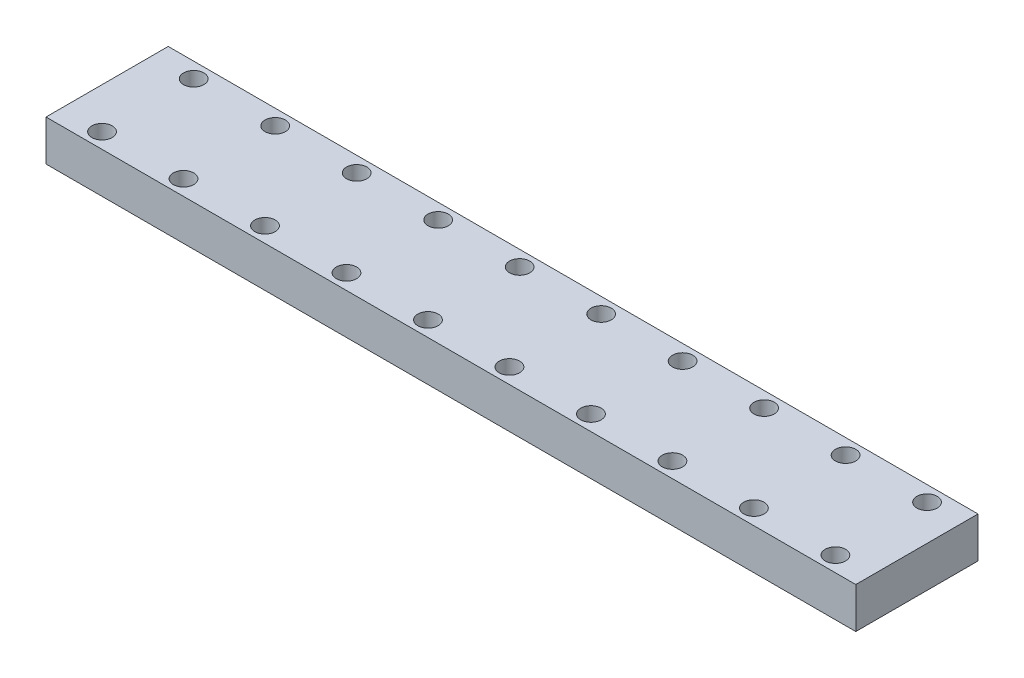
ISO-10303-21;
HEADER;
FILE_DESCRIPTION(('STEP AP214'),'2;1');
FILE_NAME('part.step','',(''),(''),'','','');
FILE_SCHEMA(('AUTOMOTIVE_DESIGN { 1 0 10303 214 1 1 1 1 }'));
ENDSEC;
DATA;
#1=APPLICATION_CONTEXT('core data for automotive mechanical design processes');
#2=APPLICATION_PROTOCOL_DEFINITION('international standard','automotive_design',2000,#1);
#3=PRODUCT_CONTEXT('',#1,'mechanical');
#4=PRODUCT('Part','Part','',(#3));
#5=PRODUCT_RELATED_PRODUCT_CATEGORY('part','',(#4));
#6=PRODUCT_DEFINITION_FORMATION('','',#4);
#7=PRODUCT_DEFINITION_CONTEXT('part definition',#1,'design');
#8=PRODUCT_DEFINITION('design','',#6,#7);
#9=PRODUCT_DEFINITION_SHAPE('','',#8);
#10=(LENGTH_UNIT() NAMED_UNIT(*) SI_UNIT(.MILLI.,.METRE.));
#11=(NAMED_UNIT(*) PLANE_ANGLE_UNIT() SI_UNIT($,.RADIAN.));
#12=(NAMED_UNIT(*) SI_UNIT($,.STERADIAN.) SOLID_ANGLE_UNIT());
#13=UNCERTAINTY_MEASURE_WITH_UNIT(LENGTH_MEASURE(1.E-05),#10,'distance_accuracy_value','');
#14=(GEOMETRIC_REPRESENTATION_CONTEXT(3) GLOBAL_UNCERTAINTY_ASSIGNED_CONTEXT((#13)) GLOBAL_UNIT_ASSIGNED_CONTEXT((#10,
#11,#12)) REPRESENTATION_CONTEXT('',''));
#15=CARTESIAN_POINT('',(0.,0.,0.));
#16=DIRECTION('',(0.,0.,1.));
#17=DIRECTION('',(1.,0.,0.));
#18=AXIS2_PLACEMENT_3D('',#15,#16,#17);
#19=CARTESIAN_POINT('',(0.,8.,0.));
#20=DIRECTION('',(0.,1.,0.));
#21=DIRECTION('',(0.,0.,1.));
#22=AXIS2_PLACEMENT_3D('',#19,#20,#21);
#23=PLANE('',#22);
#24=CARTESIAN_POINT('',(111.269565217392,8.,9.83478260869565));
#25=DIRECTION('',(0.,1.,0.));
#26=DIRECTION('',(0.,0.,1.));
#27=AXIS2_PLACEMENT_3D('',#24,#25,#26);
#28=CIRCLE('',#27,2.);
#29=CARTESIAN_POINT('',(111.269565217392,8.,11.8347826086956));
#30=VERTEX_POINT('',#29);
#31=EDGE_CURVE('E219',#30,#30,#28,.T.);
#32=ORIENTED_EDGE('',*,*,#31,.F.);
#33=EDGE_LOOP('',(#32));
#34=FACE_BOUND('',#33,.T.);
#35=CARTESIAN_POINT('',(79.2695652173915,8.,9.83478260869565));
#36=DIRECTION('',(0.,1.,0.));
#37=DIRECTION('',(0.,0.,1.));
#38=AXIS2_PLACEMENT_3D('',#35,#36,#37);
#39=CIRCLE('',#38,2.);
#40=CARTESIAN_POINT('',(79.2695652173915,8.,11.8347826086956));
#41=VERTEX_POINT('',#40);
#42=EDGE_CURVE('E207',#41,#41,#39,.T.);
#43=ORIENTED_EDGE('',*,*,#42,.F.);
#44=EDGE_LOOP('',(#43));
#45=FACE_BOUND('',#44,.T.);
#46=CARTESIAN_POINT('',(47.2695652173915,8.,9.83478260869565));
#47=DIRECTION('',(0.,1.,0.));
#48=DIRECTION('',(0.,0.,1.));
#49=AXIS2_PLACEMENT_3D('',#46,#47,#48);
#50=CIRCLE('',#49,2.);
#51=CARTESIAN_POINT('',(47.2695652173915,8.,11.8347826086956));
#52=VERTEX_POINT('',#51);
#53=EDGE_CURVE('E195',#52,#52,#50,.T.);
#54=ORIENTED_EDGE('',*,*,#53,.F.);
#55=EDGE_LOOP('',(#54));
#56=FACE_BOUND('',#55,.T.);
#57=CARTESIAN_POINT('',(15.2695652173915,8.,9.83478260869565));
#58=DIRECTION('',(0.,1.,0.));
#59=DIRECTION('',(0.,0.,1.));
#60=AXIS2_PLACEMENT_3D('',#57,#58,#59);
#61=CIRCLE('',#60,2.);
#62=CARTESIAN_POINT('',(15.2695652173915,8.,11.8347826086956));
#63=VERTEX_POINT('',#62);
#64=EDGE_CURVE('E183',#63,#63,#61,.T.);
#65=ORIENTED_EDGE('',*,*,#64,.F.);
#66=EDGE_LOOP('',(#65));
#67=FACE_BOUND('',#66,.T.);
#68=CARTESIAN_POINT('',(-16.7304347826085,8.,9.83478260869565));
#69=DIRECTION('',(0.,1.,0.));
#70=DIRECTION('',(0.,0.,1.));
#71=AXIS2_PLACEMENT_3D('',#68,#69,#70);
#72=CIRCLE('',#71,2.);
#73=CARTESIAN_POINT('',(-16.7304347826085,8.,11.8347826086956));
#74=VERTEX_POINT('',#73);
#75=EDGE_CURVE('E171',#74,#74,#72,.T.);
#76=ORIENTED_EDGE('',*,*,#75,.F.);
#77=EDGE_LOOP('',(#76));
#78=FACE_BOUND('',#77,.T.);
#79=CARTESIAN_POINT('',(111.269565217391,8.,-8.16521739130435));
#80=DIRECTION('',(0.,1.,0.));
#81=DIRECTION('',(0.,0.,1.));
#82=AXIS2_PLACEMENT_3D('',#79,#80,#81);
#83=CIRCLE('',#82,2.);
#84=CARTESIAN_POINT('',(111.269565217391,8.,-6.16521739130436));
#85=VERTEX_POINT('',#84);
#86=EDGE_CURVE('E159',#85,#85,#83,.T.);
#87=ORIENTED_EDGE('',*,*,#86,.F.);
#88=EDGE_LOOP('',(#87));
#89=FACE_BOUND('',#88,.T.);
#90=CARTESIAN_POINT('',(79.2695652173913,8.,-8.16521739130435));
#91=DIRECTION('',(0.,1.,0.));
#92=DIRECTION('',(0.,0.,1.));
#93=AXIS2_PLACEMENT_3D('',#90,#91,#92);
#94=CIRCLE('',#93,2.);
#95=CARTESIAN_POINT('',(79.2695652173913,8.,-6.16521739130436));
#96=VERTEX_POINT('',#95);
#97=EDGE_CURVE('E147',#96,#96,#94,.T.);
#98=ORIENTED_EDGE('',*,*,#97,.F.);
#99=EDGE_LOOP('',(#98));
#100=FACE_BOUND('',#99,.T.);
#101=CARTESIAN_POINT('',(47.2695652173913,8.,-8.16521739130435));
#102=DIRECTION('',(0.,1.,0.));
#103=DIRECTION('',(0.,0.,1.));
#104=AXIS2_PLACEMENT_3D('',#101,#102,#103);
#105=CIRCLE('',#104,2.);
#106=CARTESIAN_POINT('',(47.2695652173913,8.,-6.16521739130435));
#107=VERTEX_POINT('',#106);
#108=EDGE_CURVE('E135',#107,#107,#105,.T.);
#109=ORIENTED_EDGE('',*,*,#108,.F.);
#110=EDGE_LOOP('',(#109));
#111=FACE_BOUND('',#110,.T.);
#112=CARTESIAN_POINT('',(15.2695652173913,8.,-8.16521739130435));
#113=DIRECTION('',(0.,1.,0.));
#114=DIRECTION('',(0.,0.,1.));
#115=AXIS2_PLACEMENT_3D('',#112,#113,#114);
#116=CIRCLE('',#115,2.);
#117=CARTESIAN_POINT('',(15.2695652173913,8.,-6.16521739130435));
#118=VERTEX_POINT('',#117);
#119=EDGE_CURVE('E123',#118,#118,#116,.T.);
#120=ORIENTED_EDGE('',*,*,#119,.F.);
#121=EDGE_LOOP('',(#120));
#122=FACE_BOUND('',#121,.T.);
#123=CARTESIAN_POINT('',(-16.7304347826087,8.,-8.16521739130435));
#124=DIRECTION('',(0.,1.,0.));
#125=DIRECTION('',(0.,0.,1.));
#126=AXIS2_PLACEMENT_3D('',#123,#124,#125);
#127=CIRCLE('',#126,2.);
#128=CARTESIAN_POINT('',(-16.7304347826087,8.,-6.16521739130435));
#129=VERTEX_POINT('',#128);
#130=EDGE_CURVE('E102',#129,#129,#127,.T.);
#131=ORIENTED_EDGE('',*,*,#130,.F.);
#132=EDGE_LOOP('',(#131));
#133=FACE_BOUND('',#132,.T.);
#134=DIRECTION('',(0.,0.,1.));
#135=VECTOR('',#134,1.);
#136=CARTESIAN_POINT('',(-24.7304347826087,8.,-11.1652173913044));
#137=LINE('',#136,#135);
#138=CARTESIAN_POINT('',(-24.7304347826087,8.,-11.1652173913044));
#139=VERTEX_POINT('',#138);
#140=CARTESIAN_POINT('',(-24.7304347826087,8.,12.8347826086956));
#141=VERTEX_POINT('',#140);
#142=EDGE_CURVE('E87',#139,#141,#137,.T.);
#143=ORIENTED_EDGE('',*,*,#142,.T.);
#144=DIRECTION('',(1.,0.,0.));
#145=VECTOR('',#144,1.);
#146=CARTESIAN_POINT('',(-24.7304347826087,8.,12.8347826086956));
#147=LINE('',#146,#145);
#148=CARTESIAN_POINT('',(134.269565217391,8.,12.8347826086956));
#149=VERTEX_POINT('',#148);
#150=EDGE_CURVE('E82',#141,#149,#147,.T.);
#151=ORIENTED_EDGE('',*,*,#150,.T.);
#152=DIRECTION('',(0.,0.,-1.));
#153=VECTOR('',#152,1.);
#154=CARTESIAN_POINT('',(134.269565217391,8.,-11.1652173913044));
#155=LINE('',#154,#153);
#156=CARTESIAN_POINT('',(134.269565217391,8.,-11.1652173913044));
#157=VERTEX_POINT('',#156);
#158=EDGE_CURVE('E85',#149,#157,#155,.T.);
#159=ORIENTED_EDGE('',*,*,#158,.T.);
#160=DIRECTION('',(-1.,0.,0.));
#161=VECTOR('',#160,1.);
#162=CARTESIAN_POINT('',(-24.7304347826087,8.,-11.1652173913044));
#163=LINE('',#162,#161);
#164=EDGE_CURVE('E52',#157,#139,#163,.T.);
#165=ORIENTED_EDGE('',*,*,#164,.T.);
#166=EDGE_LOOP('',(#143,#151,#159,#165));
#167=FACE_BOUND('',#166,.T.);
#168=CARTESIAN_POINT('',(-0.730434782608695,8.,-8.16521739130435));
#169=DIRECTION('',(0.,1.,0.));
#170=DIRECTION('',(0.,0.,1.));
#171=AXIS2_PLACEMENT_3D('',#168,#169,#170);
#172=CIRCLE('',#171,2.);
#173=CARTESIAN_POINT('',(-0.730434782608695,8.,-6.16521739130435));
#174=VERTEX_POINT('',#173);
#175=EDGE_CURVE('E117',#174,#174,#172,.T.);
#176=ORIENTED_EDGE('',*,*,#175,.F.);
#177=EDGE_LOOP('',(#176));
#178=FACE_BOUND('',#177,.T.);
#179=CARTESIAN_POINT('',(31.2695652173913,8.,-8.16521739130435));
#180=DIRECTION('',(0.,1.,0.));
#181=DIRECTION('',(0.,0.,1.));
#182=AXIS2_PLACEMENT_3D('',#179,#180,#181);
#183=CIRCLE('',#182,2.);
#184=CARTESIAN_POINT('',(31.2695652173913,8.,-6.16521739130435));
#185=VERTEX_POINT('',#184);
#186=EDGE_CURVE('E129',#185,#185,#183,.T.);
#187=ORIENTED_EDGE('',*,*,#186,.F.);
#188=EDGE_LOOP('',(#187));
#189=FACE_BOUND('',#188,.T.);
#190=CARTESIAN_POINT('',(63.2695652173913,8.,-8.16521739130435));
#191=DIRECTION('',(0.,1.,0.));
#192=DIRECTION('',(0.,0.,1.));
#193=AXIS2_PLACEMENT_3D('',#190,#191,#192);
#194=CIRCLE('',#193,2.00000000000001);
#195=CARTESIAN_POINT('',(63.2695652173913,8.,-6.16521739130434));
#196=VERTEX_POINT('',#195);
#197=EDGE_CURVE('E141',#196,#196,#194,.T.);
#198=ORIENTED_EDGE('',*,*,#197,.F.);
#199=EDGE_LOOP('',(#198));
#200=FACE_BOUND('',#199,.T.);
#201=CARTESIAN_POINT('',(95.2695652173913,8.,-8.16521739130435));
#202=DIRECTION('',(0.,1.,0.));
#203=DIRECTION('',(0.,0.,1.));
#204=AXIS2_PLACEMENT_3D('',#201,#202,#203);
#205=CIRCLE('',#204,2.00000000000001);
#206=CARTESIAN_POINT('',(95.2695652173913,8.,-6.16521739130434));
#207=VERTEX_POINT('',#206);
#208=EDGE_CURVE('E153',#207,#207,#205,.T.);
#209=ORIENTED_EDGE('',*,*,#208,.F.);
#210=EDGE_LOOP('',(#209));
#211=FACE_BOUND('',#210,.T.);
#212=CARTESIAN_POINT('',(127.269565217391,8.,-8.16521739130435));
#213=DIRECTION('',(0.,1.,0.));
#214=DIRECTION('',(0.,0.,1.));
#215=AXIS2_PLACEMENT_3D('',#212,#213,#214);
#216=CIRCLE('',#215,2.);
#217=CARTESIAN_POINT('',(127.269565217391,8.,-6.16521739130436));
#218=VERTEX_POINT('',#217);
#219=EDGE_CURVE('E165',#218,#218,#216,.T.);
#220=ORIENTED_EDGE('',*,*,#219,.F.);
#221=EDGE_LOOP('',(#220));
#222=FACE_BOUND('',#221,.T.);
#223=CARTESIAN_POINT('',(-0.730434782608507,8.,9.83478260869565));
#224=DIRECTION('',(0.,1.,0.));
#225=DIRECTION('',(0.,0.,1.));
#226=AXIS2_PLACEMENT_3D('',#223,#224,#225);
#227=CIRCLE('',#226,2.);
#228=CARTESIAN_POINT('',(-0.730434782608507,8.,11.8347826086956));
#229=VERTEX_POINT('',#228);
#230=EDGE_CURVE('E177',#229,#229,#227,.T.);
#231=ORIENTED_EDGE('',*,*,#230,.F.);
#232=EDGE_LOOP('',(#231));
#233=FACE_BOUND('',#232,.T.);
#234=CARTESIAN_POINT('',(31.2695652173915,8.,9.83478260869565));
#235=DIRECTION('',(0.,1.,0.));
#236=DIRECTION('',(0.,0.,1.));
#237=AXIS2_PLACEMENT_3D('',#234,#235,#236);
#238=CIRCLE('',#237,2.);
#239=CARTESIAN_POINT('',(31.2695652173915,8.,11.8347826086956));
#240=VERTEX_POINT('',#239);
#241=EDGE_CURVE('E189',#240,#240,#238,.T.);
#242=ORIENTED_EDGE('',*,*,#241,.F.);
#243=EDGE_LOOP('',(#242));
#244=FACE_BOUND('',#243,.T.);
#245=CARTESIAN_POINT('',(63.2695652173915,8.,9.83478260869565));
#246=DIRECTION('',(0.,1.,0.));
#247=DIRECTION('',(0.,0.,1.));
#248=AXIS2_PLACEMENT_3D('',#245,#246,#247);
#249=CIRCLE('',#248,2.00000000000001);
#250=CARTESIAN_POINT('',(63.2695652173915,8.,11.8347826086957));
#251=VERTEX_POINT('',#250);
#252=EDGE_CURVE('E201',#251,#251,#249,.T.);
#253=ORIENTED_EDGE('',*,*,#252,.F.);
#254=EDGE_LOOP('',(#253));
#255=FACE_BOUND('',#254,.T.);
#256=CARTESIAN_POINT('',(95.2695652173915,8.,9.83478260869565));
#257=DIRECTION('',(0.,1.,0.));
#258=DIRECTION('',(0.,0.,1.));
#259=AXIS2_PLACEMENT_3D('',#256,#257,#258);
#260=CIRCLE('',#259,2.00000000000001);
#261=CARTESIAN_POINT('',(95.2695652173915,8.,11.8347826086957));
#262=VERTEX_POINT('',#261);
#263=EDGE_CURVE('E213',#262,#262,#260,.T.);
#264=ORIENTED_EDGE('',*,*,#263,.F.);
#265=EDGE_LOOP('',(#264));
#266=FACE_BOUND('',#265,.T.);
#267=CARTESIAN_POINT('',(127.269565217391,8.,9.83478260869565));
#268=DIRECTION('',(0.,1.,0.));
#269=DIRECTION('',(0.,0.,1.));
#270=AXIS2_PLACEMENT_3D('',#267,#268,#269);
#271=CIRCLE('',#270,2.);
#272=CARTESIAN_POINT('',(127.269565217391,8.,11.8347826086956));
#273=VERTEX_POINT('',#272);
#274=EDGE_CURVE('E225',#273,#273,#271,.T.);
#275=ORIENTED_EDGE('',*,*,#274,.F.);
#276=EDGE_LOOP('',(#275));
#277=FACE_BOUND('',#276,.T.);
#278=ADVANCED_FACE('F35',(#34,#45,#56,#67,#78,#89,#100,#111,#122,#133,#167,#178,#189,#200,#211,
#222,#233,#244,#255,#266,#277),#23,.T.);
#279=CARTESIAN_POINT('',(0.,0.,0.));
#280=DIRECTION('',(0.,1.,0.));
#281=DIRECTION('',(0.,0.,1.));
#282=AXIS2_PLACEMENT_3D('',#279,#280,#281);
#283=PLANE('',#282);
#284=DIRECTION('',(0.,0.,1.));
#285=VECTOR('',#284,1.);
#286=CARTESIAN_POINT('',(-24.7304347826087,0.,-11.1652173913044));
#287=LINE('',#286,#285);
#288=CARTESIAN_POINT('',(-24.7304347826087,0.,-11.1652173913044));
#289=VERTEX_POINT('',#288);
#290=CARTESIAN_POINT('',(-24.7304347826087,0.,12.8347826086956));
#291=VERTEX_POINT('',#290);
#292=EDGE_CURVE('E99',#289,#291,#287,.T.);
#293=ORIENTED_EDGE('',*,*,#292,.F.);
#294=DIRECTION('',(-1.,0.,0.));
#295=VECTOR('',#294,1.);
#296=CARTESIAN_POINT('',(-24.7304347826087,0.,-11.1652173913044));
#297=LINE('',#296,#295);
#298=CARTESIAN_POINT('',(134.269565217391,0.,-11.1652173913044));
#299=VERTEX_POINT('',#298);
#300=EDGE_CURVE('E75',#299,#289,#297,.T.);
#301=ORIENTED_EDGE('',*,*,#300,.F.);
#302=DIRECTION('',(0.,0.,-1.));
#303=VECTOR('',#302,1.);
#304=CARTESIAN_POINT('',(134.269565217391,0.,-11.1652173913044));
#305=LINE('',#304,#303);
#306=CARTESIAN_POINT('',(134.269565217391,0.,12.8347826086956));
#307=VERTEX_POINT('',#306);
#308=EDGE_CURVE('E69',#307,#299,#305,.T.);
#309=ORIENTED_EDGE('',*,*,#308,.F.);
#310=DIRECTION('',(1.,0.,0.));
#311=VECTOR('',#310,1.);
#312=CARTESIAN_POINT('',(-24.7304347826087,0.,12.8347826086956));
#313=LINE('',#312,#311);
#314=EDGE_CURVE('E91',#291,#307,#313,.T.);
#315=ORIENTED_EDGE('',*,*,#314,.F.);
#316=EDGE_LOOP('',(#293,#301,#309,#315));
#317=FACE_BOUND('',#316,.T.);
#318=CARTESIAN_POINT('',(-16.7304347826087,0.,-8.16521739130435));
#319=DIRECTION('',(0.,1.,0.));
#320=DIRECTION('',(0.,0.,1.));
#321=AXIS2_PLACEMENT_3D('',#318,#319,#320);
#322=CIRCLE('',#321,2.);
#323=CARTESIAN_POINT('',(-16.7304347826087,0.,-6.16521739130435));
#324=VERTEX_POINT('',#323);
#325=EDGE_CURVE('E114',#324,#324,#322,.T.);
#326=ORIENTED_EDGE('',*,*,#325,.T.);
#327=EDGE_LOOP('',(#326));
#328=FACE_BOUND('',#327,.T.);
#329=CARTESIAN_POINT('',(-0.730434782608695,0.,-8.16521739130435));
#330=DIRECTION('',(0.,1.,0.));
#331=DIRECTION('',(0.,0.,1.));
#332=AXIS2_PLACEMENT_3D('',#329,#330,#331);
#333=CIRCLE('',#332,2.);
#334=CARTESIAN_POINT('',(-0.730434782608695,0.,-6.16521739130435));
#335=VERTEX_POINT('',#334);
#336=EDGE_CURVE('E120',#335,#335,#333,.T.);
#337=ORIENTED_EDGE('',*,*,#336,.T.);
#338=EDGE_LOOP('',(#337));
#339=FACE_BOUND('',#338,.T.);
#340=CARTESIAN_POINT('',(15.2695652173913,0.,-8.16521739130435));
#341=DIRECTION('',(0.,1.,0.));
#342=DIRECTION('',(0.,0.,1.));
#343=AXIS2_PLACEMENT_3D('',#340,#341,#342);
#344=CIRCLE('',#343,2.);
#345=CARTESIAN_POINT('',(15.2695652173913,0.,-6.16521739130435));
#346=VERTEX_POINT('',#345);
#347=EDGE_CURVE('E126',#346,#346,#344,.T.);
#348=ORIENTED_EDGE('',*,*,#347,.T.);
#349=EDGE_LOOP('',(#348));
#350=FACE_BOUND('',#349,.T.);
#351=CARTESIAN_POINT('',(31.2695652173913,0.,-8.16521739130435));
#352=DIRECTION('',(0.,1.,0.));
#353=DIRECTION('',(0.,0.,1.));
#354=AXIS2_PLACEMENT_3D('',#351,#352,#353);
#355=CIRCLE('',#354,2.);
#356=CARTESIAN_POINT('',(31.2695652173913,0.,-6.16521739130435));
#357=VERTEX_POINT('',#356);
#358=EDGE_CURVE('E132',#357,#357,#355,.T.);
#359=ORIENTED_EDGE('',*,*,#358,.T.);
#360=EDGE_LOOP('',(#359));
#361=FACE_BOUND('',#360,.T.);
#362=CARTESIAN_POINT('',(47.2695652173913,0.,-8.16521739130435));
#363=DIRECTION('',(0.,1.,0.));
#364=DIRECTION('',(0.,0.,1.));
#365=AXIS2_PLACEMENT_3D('',#362,#363,#364);
#366=CIRCLE('',#365,2.);
#367=CARTESIAN_POINT('',(47.2695652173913,0.,-6.16521739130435));
#368=VERTEX_POINT('',#367);
#369=EDGE_CURVE('E138',#368,#368,#366,.T.);
#370=ORIENTED_EDGE('',*,*,#369,.T.);
#371=EDGE_LOOP('',(#370));
#372=FACE_BOUND('',#371,.T.);
#373=CARTESIAN_POINT('',(63.2695652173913,0.,-8.16521739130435));
#374=DIRECTION('',(0.,1.,0.));
#375=DIRECTION('',(0.,0.,1.));
#376=AXIS2_PLACEMENT_3D('',#373,#374,#375);
#377=CIRCLE('',#376,2.00000000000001);
#378=CARTESIAN_POINT('',(63.2695652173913,0.,-6.16521739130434));
#379=VERTEX_POINT('',#378);
#380=EDGE_CURVE('E144',#379,#379,#377,.T.);
#381=ORIENTED_EDGE('',*,*,#380,.T.);
#382=EDGE_LOOP('',(#381));
#383=FACE_BOUND('',#382,.T.);
#384=CARTESIAN_POINT('',(79.2695652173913,0.,-8.16521739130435));
#385=DIRECTION('',(0.,1.,0.));
#386=DIRECTION('',(0.,0.,1.));
#387=AXIS2_PLACEMENT_3D('',#384,#385,#386);
#388=CIRCLE('',#387,2.);
#389=CARTESIAN_POINT('',(79.2695652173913,0.,-6.16521739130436));
#390=VERTEX_POINT('',#389);
#391=EDGE_CURVE('E150',#390,#390,#388,.T.);
#392=ORIENTED_EDGE('',*,*,#391,.T.);
#393=EDGE_LOOP('',(#392));
#394=FACE_BOUND('',#393,.T.);
#395=CARTESIAN_POINT('',(95.2695652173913,0.,-8.16521739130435));
#396=DIRECTION('',(0.,1.,0.));
#397=DIRECTION('',(0.,0.,1.));
#398=AXIS2_PLACEMENT_3D('',#395,#396,#397);
#399=CIRCLE('',#398,2.00000000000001);
#400=CARTESIAN_POINT('',(95.2695652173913,0.,-6.16521739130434));
#401=VERTEX_POINT('',#400);
#402=EDGE_CURVE('E156',#401,#401,#399,.T.);
#403=ORIENTED_EDGE('',*,*,#402,.T.);
#404=EDGE_LOOP('',(#403));
#405=FACE_BOUND('',#404,.T.);
#406=CARTESIAN_POINT('',(111.269565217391,0.,-8.16521739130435));
#407=DIRECTION('',(0.,1.,0.));
#408=DIRECTION('',(0.,0.,1.));
#409=AXIS2_PLACEMENT_3D('',#406,#407,#408);
#410=CIRCLE('',#409,2.);
#411=CARTESIAN_POINT('',(111.269565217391,0.,-6.16521739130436));
#412=VERTEX_POINT('',#411);
#413=EDGE_CURVE('E162',#412,#412,#410,.T.);
#414=ORIENTED_EDGE('',*,*,#413,.T.);
#415=EDGE_LOOP('',(#414));
#416=FACE_BOUND('',#415,.T.);
#417=CARTESIAN_POINT('',(127.269565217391,0.,-8.16521739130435));
#418=DIRECTION('',(0.,1.,0.));
#419=DIRECTION('',(0.,0.,1.));
#420=AXIS2_PLACEMENT_3D('',#417,#418,#419);
#421=CIRCLE('',#420,2.);
#422=CARTESIAN_POINT('',(127.269565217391,0.,-6.16521739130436));
#423=VERTEX_POINT('',#422);
#424=EDGE_CURVE('E168',#423,#423,#421,.T.);
#425=ORIENTED_EDGE('',*,*,#424,.T.);
#426=EDGE_LOOP('',(#425));
#427=FACE_BOUND('',#426,.T.);
#428=CARTESIAN_POINT('',(-16.7304347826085,0.,9.83478260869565));
#429=DIRECTION('',(0.,1.,0.));
#430=DIRECTION('',(0.,0.,1.));
#431=AXIS2_PLACEMENT_3D('',#428,#429,#430);
#432=CIRCLE('',#431,2.);
#433=CARTESIAN_POINT('',(-16.7304347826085,0.,11.8347826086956));
#434=VERTEX_POINT('',#433);
#435=EDGE_CURVE('E174',#434,#434,#432,.T.);
#436=ORIENTED_EDGE('',*,*,#435,.T.);
#437=EDGE_LOOP('',(#436));
#438=FACE_BOUND('',#437,.T.);
#439=CARTESIAN_POINT('',(-0.730434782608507,0.,9.83478260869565));
#440=DIRECTION('',(0.,1.,0.));
#441=DIRECTION('',(0.,0.,1.));
#442=AXIS2_PLACEMENT_3D('',#439,#440,#441);
#443=CIRCLE('',#442,2.);
#444=CARTESIAN_POINT('',(-0.730434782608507,0.,11.8347826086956));
#445=VERTEX_POINT('',#444);
#446=EDGE_CURVE('E180',#445,#445,#443,.T.);
#447=ORIENTED_EDGE('',*,*,#446,.T.);
#448=EDGE_LOOP('',(#447));
#449=FACE_BOUND('',#448,.T.);
#450=CARTESIAN_POINT('',(15.2695652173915,0.,9.83478260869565));
#451=DIRECTION('',(0.,1.,0.));
#452=DIRECTION('',(0.,0.,1.));
#453=AXIS2_PLACEMENT_3D('',#450,#451,#452);
#454=CIRCLE('',#453,2.);
#455=CARTESIAN_POINT('',(15.2695652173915,0.,11.8347826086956));
#456=VERTEX_POINT('',#455);
#457=EDGE_CURVE('E186',#456,#456,#454,.T.);
#458=ORIENTED_EDGE('',*,*,#457,.T.);
#459=EDGE_LOOP('',(#458));
#460=FACE_BOUND('',#459,.T.);
#461=CARTESIAN_POINT('',(31.2695652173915,0.,9.83478260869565));
#462=DIRECTION('',(0.,1.,0.));
#463=DIRECTION('',(0.,0.,1.));
#464=AXIS2_PLACEMENT_3D('',#461,#462,#463);
#465=CIRCLE('',#464,2.);
#466=CARTESIAN_POINT('',(31.2695652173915,0.,11.8347826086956));
#467=VERTEX_POINT('',#466);
#468=EDGE_CURVE('E192',#467,#467,#465,.T.);
#469=ORIENTED_EDGE('',*,*,#468,.T.);
#470=EDGE_LOOP('',(#469));
#471=FACE_BOUND('',#470,.T.);
#472=CARTESIAN_POINT('',(47.2695652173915,0.,9.83478260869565));
#473=DIRECTION('',(0.,1.,0.));
#474=DIRECTION('',(0.,0.,1.));
#475=AXIS2_PLACEMENT_3D('',#472,#473,#474);
#476=CIRCLE('',#475,2.);
#477=CARTESIAN_POINT('',(47.2695652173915,0.,11.8347826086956));
#478=VERTEX_POINT('',#477);
#479=EDGE_CURVE('E198',#478,#478,#476,.T.);
#480=ORIENTED_EDGE('',*,*,#479,.T.);
#481=EDGE_LOOP('',(#480));
#482=FACE_BOUND('',#481,.T.);
#483=CARTESIAN_POINT('',(63.2695652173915,0.,9.83478260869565));
#484=DIRECTION('',(0.,1.,0.));
#485=DIRECTION('',(0.,0.,1.));
#486=AXIS2_PLACEMENT_3D('',#483,#484,#485);
#487=CIRCLE('',#486,2.00000000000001);
#488=CARTESIAN_POINT('',(63.2695652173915,0.,11.8347826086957));
#489=VERTEX_POINT('',#488);
#490=EDGE_CURVE('E204',#489,#489,#487,.T.);
#491=ORIENTED_EDGE('',*,*,#490,.T.);
#492=EDGE_LOOP('',(#491));
#493=FACE_BOUND('',#492,.T.);
#494=CARTESIAN_POINT('',(79.2695652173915,0.,9.83478260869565));
#495=DIRECTION('',(0.,1.,0.));
#496=DIRECTION('',(0.,0.,1.));
#497=AXIS2_PLACEMENT_3D('',#494,#495,#496);
#498=CIRCLE('',#497,2.);
#499=CARTESIAN_POINT('',(79.2695652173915,0.,11.8347826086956));
#500=VERTEX_POINT('',#499);
#501=EDGE_CURVE('E210',#500,#500,#498,.T.);
#502=ORIENTED_EDGE('',*,*,#501,.T.);
#503=EDGE_LOOP('',(#502));
#504=FACE_BOUND('',#503,.T.);
#505=CARTESIAN_POINT('',(95.2695652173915,0.,9.83478260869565));
#506=DIRECTION('',(0.,1.,0.));
#507=DIRECTION('',(0.,0.,1.));
#508=AXIS2_PLACEMENT_3D('',#505,#506,#507);
#509=CIRCLE('',#508,2.00000000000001);
#510=CARTESIAN_POINT('',(95.2695652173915,0.,11.8347826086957));
#511=VERTEX_POINT('',#510);
#512=EDGE_CURVE('E216',#511,#511,#509,.T.);
#513=ORIENTED_EDGE('',*,*,#512,.T.);
#514=EDGE_LOOP('',(#513));
#515=FACE_BOUND('',#514,.T.);
#516=CARTESIAN_POINT('',(111.269565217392,0.,9.83478260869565));
#517=DIRECTION('',(0.,1.,0.));
#518=DIRECTION('',(0.,0.,1.));
#519=AXIS2_PLACEMENT_3D('',#516,#517,#518);
#520=CIRCLE('',#519,2.);
#521=CARTESIAN_POINT('',(111.269565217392,0.,11.8347826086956));
#522=VERTEX_POINT('',#521);
#523=EDGE_CURVE('E222',#522,#522,#520,.T.);
#524=ORIENTED_EDGE('',*,*,#523,.T.);
#525=EDGE_LOOP('',(#524));
#526=FACE_BOUND('',#525,.T.);
#527=CARTESIAN_POINT('',(127.269565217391,0.,9.83478260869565));
#528=DIRECTION('',(0.,1.,0.));
#529=DIRECTION('',(0.,0.,1.));
#530=AXIS2_PLACEMENT_3D('',#527,#528,#529);
#531=CIRCLE('',#530,2.);
#532=CARTESIAN_POINT('',(127.269565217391,0.,11.8347826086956));
#533=VERTEX_POINT('',#532);
#534=EDGE_CURVE('E228',#533,#533,#531,.T.);
#535=ORIENTED_EDGE('',*,*,#534,.T.);
#536=EDGE_LOOP('',(#535));
#537=FACE_BOUND('',#536,.T.);
#538=ADVANCED_FACE('F110',(#317,#328,#339,#350,#361,#372,#383,#394,#405,#416,#427,#438,#449,
#460,#471,#482,#493,#504,#515,#526,#537),#283,.F.);
#539=CARTESIAN_POINT('',(-24.7304347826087,8.,-11.1652173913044));
#540=DIRECTION('',(1.,0.,0.));
#541=DIRECTION('',(0.,0.,-1.));
#542=AXIS2_PLACEMENT_3D('',#539,#540,#541);
#543=PLANE('',#542);
#544=ORIENTED_EDGE('',*,*,#292,.T.);
#545=DIRECTION('',(0.,-1.,0.));
#546=VECTOR('',#545,1.);
#547=CARTESIAN_POINT('',(-24.7304347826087,8.,12.8347826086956));
#548=LINE('',#547,#546);
#549=EDGE_CURVE('E11',#141,#291,#548,.T.);
#550=ORIENTED_EDGE('',*,*,#549,.F.);
#551=ORIENTED_EDGE('',*,*,#142,.F.);
#552=DIRECTION('',(0.,-1.,0.));
#553=VECTOR('',#552,1.);
#554=CARTESIAN_POINT('',(-24.7304347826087,8.,-11.1652173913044));
#555=LINE('',#554,#553);
#556=EDGE_CURVE('E95',#139,#289,#555,.T.);
#557=ORIENTED_EDGE('',*,*,#556,.T.);
#558=EDGE_LOOP('',(#544,#550,#551,#557));
#559=FACE_BOUND('',#558,.T.);
#560=ADVANCED_FACE('F37',(#559),#543,.F.);
#561=CARTESIAN_POINT('',(-24.7304347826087,8.,12.8347826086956));
#562=DIRECTION('',(0.,0.,-1.));
#563=DIRECTION('',(-1.,0.,0.));
#564=AXIS2_PLACEMENT_3D('',#561,#562,#563);
#565=PLANE('',#564);
#566=ORIENTED_EDGE('',*,*,#314,.T.);
#567=DIRECTION('',(0.,-1.,0.));
#568=VECTOR('',#567,1.);
#569=CARTESIAN_POINT('',(134.269565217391,8.,12.8347826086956));
#570=LINE('',#569,#568);
#571=EDGE_CURVE('E44',#149,#307,#570,.T.);
#572=ORIENTED_EDGE('',*,*,#571,.F.);
#573=ORIENTED_EDGE('',*,*,#150,.F.);
#574=ORIENTED_EDGE('',*,*,#549,.T.);
#575=EDGE_LOOP('',(#566,#572,#573,#574));
#576=FACE_BOUND('',#575,.T.);
#577=ADVANCED_FACE('F90',(#576),#565,.F.);
#578=CARTESIAN_POINT('',(134.269565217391,8.,-11.1652173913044));
#579=DIRECTION('',(-1.,0.,0.));
#580=DIRECTION('',(0.,0.,1.));
#581=AXIS2_PLACEMENT_3D('',#578,#579,#580);
#582=PLANE('',#581);
#583=ORIENTED_EDGE('',*,*,#308,.T.);
#584=DIRECTION('',(0.,-1.,0.));
#585=VECTOR('',#584,1.);
#586=CARTESIAN_POINT('',(134.269565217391,8.,-11.1652173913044));
#587=LINE('',#586,#585);
#588=EDGE_CURVE('E92',#157,#299,#587,.T.);
#589=ORIENTED_EDGE('',*,*,#588,.F.);
#590=ORIENTED_EDGE('',*,*,#158,.F.);
#591=ORIENTED_EDGE('',*,*,#571,.T.);
#592=EDGE_LOOP('',(#583,#589,#590,#591));
#593=FACE_BOUND('',#592,.T.);
#594=ADVANCED_FACE('F93',(#593),#582,.F.);
#595=CARTESIAN_POINT('',(-24.7304347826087,8.,-11.1652173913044));
#596=DIRECTION('',(0.,0.,1.));
#597=DIRECTION('',(1.,0.,0.));
#598=AXIS2_PLACEMENT_3D('',#595,#596,#597);
#599=PLANE('',#598);
#600=ORIENTED_EDGE('',*,*,#300,.T.);
#601=ORIENTED_EDGE('',*,*,#556,.F.);
#602=ORIENTED_EDGE('',*,*,#164,.F.);
#603=ORIENTED_EDGE('',*,*,#588,.T.);
#604=EDGE_LOOP('',(#600,#601,#602,#603));
#605=FACE_BOUND('',#604,.T.);
#606=ADVANCED_FACE('F107',(#605),#599,.F.);
#607=CARTESIAN_POINT('',(-16.7304347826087,8.,-8.16521739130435));
#608=DIRECTION('',(0.,-1.,0.));
#609=DIRECTION('',(0.,0.,-1.));
#610=AXIS2_PLACEMENT_3D('',#607,#608,#609);
#611=CYLINDRICAL_SURFACE('',#610,2.);
#612=ORIENTED_EDGE('',*,*,#130,.T.);
#613=EDGE_LOOP('',(#612));
#614=FACE_BOUND('',#613,.T.);
#615=ORIENTED_EDGE('',*,*,#325,.F.);
#616=EDGE_LOOP('',(#615));
#617=FACE_BOUND('',#616,.T.);
#618=ADVANCED_FACE('F247',(#614,#617),#611,.F.);
#619=CARTESIAN_POINT('',(-0.730434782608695,8.,-8.16521739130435));
#620=DIRECTION('',(0.,-1.,0.));
#621=DIRECTION('',(0.,0.,-1.));
#622=AXIS2_PLACEMENT_3D('',#619,#620,#621);
#623=CYLINDRICAL_SURFACE('',#622,2.);
#624=ORIENTED_EDGE('',*,*,#175,.T.);
#625=EDGE_LOOP('',(#624));
#626=FACE_BOUND('',#625,.T.);
#627=ORIENTED_EDGE('',*,*,#336,.F.);
#628=EDGE_LOOP('',(#627));
#629=FACE_BOUND('',#628,.T.);
#630=ADVANCED_FACE('F293',(#626,#629),#623,.F.);
#631=CARTESIAN_POINT('',(15.2695652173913,8.,-8.16521739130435));
#632=DIRECTION('',(0.,-1.,0.));
#633=DIRECTION('',(0.,0.,-1.));
#634=AXIS2_PLACEMENT_3D('',#631,#632,#633);
#635=CYLINDRICAL_SURFACE('',#634,2.);
#636=ORIENTED_EDGE('',*,*,#119,.T.);
#637=EDGE_LOOP('',(#636));
#638=FACE_BOUND('',#637,.T.);
#639=ORIENTED_EDGE('',*,*,#347,.F.);
#640=EDGE_LOOP('',(#639));
#641=FACE_BOUND('',#640,.T.);
#642=ADVANCED_FACE('F301',(#638,#641),#635,.F.);
#643=CARTESIAN_POINT('',(31.2695652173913,8.,-8.16521739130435));
#644=DIRECTION('',(0.,-1.,0.));
#645=DIRECTION('',(0.,0.,-1.));
#646=AXIS2_PLACEMENT_3D('',#643,#644,#645);
#647=CYLINDRICAL_SURFACE('',#646,2.);
#648=ORIENTED_EDGE('',*,*,#186,.T.);
#649=EDGE_LOOP('',(#648));
#650=FACE_BOUND('',#649,.T.);
#651=ORIENTED_EDGE('',*,*,#358,.F.);
#652=EDGE_LOOP('',(#651));
#653=FACE_BOUND('',#652,.T.);
#654=ADVANCED_FACE('F309',(#650,#653),#647,.F.);
#655=CARTESIAN_POINT('',(47.2695652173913,8.,-8.16521739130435));
#656=DIRECTION('',(0.,-1.,0.));
#657=DIRECTION('',(0.,0.,-1.));
#658=AXIS2_PLACEMENT_3D('',#655,#656,#657);
#659=CYLINDRICAL_SURFACE('',#658,2.);
#660=ORIENTED_EDGE('',*,*,#108,.T.);
#661=EDGE_LOOP('',(#660));
#662=FACE_BOUND('',#661,.T.);
#663=ORIENTED_EDGE('',*,*,#369,.F.);
#664=EDGE_LOOP('',(#663));
#665=FACE_BOUND('',#664,.T.);
#666=ADVANCED_FACE('F318',(#662,#665),#659,.F.);
#667=CARTESIAN_POINT('',(63.2695652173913,8.,-8.16521739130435));
#668=DIRECTION('',(0.,-1.,0.));
#669=DIRECTION('',(0.,0.,-1.));
#670=AXIS2_PLACEMENT_3D('',#667,#668,#669);
#671=CYLINDRICAL_SURFACE('',#670,2.00000000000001);
#672=ORIENTED_EDGE('',*,*,#197,.T.);
#673=EDGE_LOOP('',(#672));
#674=FACE_BOUND('',#673,.T.);
#675=ORIENTED_EDGE('',*,*,#380,.F.);
#676=EDGE_LOOP('',(#675));
#677=FACE_BOUND('',#676,.T.);
#678=ADVANCED_FACE('F327',(#674,#677),#671,.F.);
#679=CARTESIAN_POINT('',(79.2695652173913,8.,-8.16521739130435));
#680=DIRECTION('',(0.,-1.,0.));
#681=DIRECTION('',(0.,0.,-1.));
#682=AXIS2_PLACEMENT_3D('',#679,#680,#681);
#683=CYLINDRICAL_SURFACE('',#682,2.);
#684=ORIENTED_EDGE('',*,*,#97,.T.);
#685=EDGE_LOOP('',(#684));
#686=FACE_BOUND('',#685,.T.);
#687=ORIENTED_EDGE('',*,*,#391,.F.);
#688=EDGE_LOOP('',(#687));
#689=FACE_BOUND('',#688,.T.);
#690=ADVANCED_FACE('F336',(#686,#689),#683,.F.);
#691=CARTESIAN_POINT('',(95.2695652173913,8.,-8.16521739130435));
#692=DIRECTION('',(0.,-1.,0.));
#693=DIRECTION('',(0.,0.,-1.));
#694=AXIS2_PLACEMENT_3D('',#691,#692,#693);
#695=CYLINDRICAL_SURFACE('',#694,2.00000000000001);
#696=ORIENTED_EDGE('',*,*,#208,.T.);
#697=EDGE_LOOP('',(#696));
#698=FACE_BOUND('',#697,.T.);
#699=ORIENTED_EDGE('',*,*,#402,.F.);
#700=EDGE_LOOP('',(#699));
#701=FACE_BOUND('',#700,.T.);
#702=ADVANCED_FACE('F345',(#698,#701),#695,.F.);
#703=CARTESIAN_POINT('',(111.269565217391,8.,-8.16521739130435));
#704=DIRECTION('',(0.,-1.,0.));
#705=DIRECTION('',(0.,0.,-1.));
#706=AXIS2_PLACEMENT_3D('',#703,#704,#705);
#707=CYLINDRICAL_SURFACE('',#706,2.);
#708=ORIENTED_EDGE('',*,*,#86,.T.);
#709=EDGE_LOOP('',(#708));
#710=FACE_BOUND('',#709,.T.);
#711=ORIENTED_EDGE('',*,*,#413,.F.);
#712=EDGE_LOOP('',(#711));
#713=FACE_BOUND('',#712,.T.);
#714=ADVANCED_FACE('F354',(#710,#713),#707,.F.);
#715=CARTESIAN_POINT('',(127.269565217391,8.,-8.16521739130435));
#716=DIRECTION('',(0.,-1.,0.));
#717=DIRECTION('',(0.,0.,-1.));
#718=AXIS2_PLACEMENT_3D('',#715,#716,#717);
#719=CYLINDRICAL_SURFACE('',#718,2.);
#720=ORIENTED_EDGE('',*,*,#219,.T.);
#721=EDGE_LOOP('',(#720));
#722=FACE_BOUND('',#721,.T.);
#723=ORIENTED_EDGE('',*,*,#424,.F.);
#724=EDGE_LOOP('',(#723));
#725=FACE_BOUND('',#724,.T.);
#726=ADVANCED_FACE('F363',(#722,#725),#719,.F.);
#727=CARTESIAN_POINT('',(-16.7304347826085,8.,9.83478260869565));
#728=DIRECTION('',(0.,-1.,0.));
#729=DIRECTION('',(0.,0.,-1.));
#730=AXIS2_PLACEMENT_3D('',#727,#728,#729);
#731=CYLINDRICAL_SURFACE('',#730,2.);
#732=ORIENTED_EDGE('',*,*,#75,.T.);
#733=EDGE_LOOP('',(#732));
#734=FACE_BOUND('',#733,.T.);
#735=ORIENTED_EDGE('',*,*,#435,.F.);
#736=EDGE_LOOP('',(#735));
#737=FACE_BOUND('',#736,.T.);
#738=ADVANCED_FACE('F372',(#734,#737),#731,.F.);
#739=CARTESIAN_POINT('',(-0.730434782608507,8.,9.83478260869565));
#740=DIRECTION('',(0.,-1.,0.));
#741=DIRECTION('',(0.,0.,-1.));
#742=AXIS2_PLACEMENT_3D('',#739,#740,#741);
#743=CYLINDRICAL_SURFACE('',#742,2.);
#744=ORIENTED_EDGE('',*,*,#230,.T.);
#745=EDGE_LOOP('',(#744));
#746=FACE_BOUND('',#745,.T.);
#747=ORIENTED_EDGE('',*,*,#446,.F.);
#748=EDGE_LOOP('',(#747));
#749=FACE_BOUND('',#748,.T.);
#750=ADVANCED_FACE('F381',(#746,#749),#743,.F.);
#751=CARTESIAN_POINT('',(15.2695652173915,8.,9.83478260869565));
#752=DIRECTION('',(0.,-1.,0.));
#753=DIRECTION('',(0.,0.,-1.));
#754=AXIS2_PLACEMENT_3D('',#751,#752,#753);
#755=CYLINDRICAL_SURFACE('',#754,2.);
#756=ORIENTED_EDGE('',*,*,#64,.T.);
#757=EDGE_LOOP('',(#756));
#758=FACE_BOUND('',#757,.T.);
#759=ORIENTED_EDGE('',*,*,#457,.F.);
#760=EDGE_LOOP('',(#759));
#761=FACE_BOUND('',#760,.T.);
#762=ADVANCED_FACE('F390',(#758,#761),#755,.F.);
#763=CARTESIAN_POINT('',(31.2695652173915,8.,9.83478260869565));
#764=DIRECTION('',(0.,-1.,0.));
#765=DIRECTION('',(0.,0.,-1.));
#766=AXIS2_PLACEMENT_3D('',#763,#764,#765);
#767=CYLINDRICAL_SURFACE('',#766,2.);
#768=ORIENTED_EDGE('',*,*,#241,.T.);
#769=EDGE_LOOP('',(#768));
#770=FACE_BOUND('',#769,.T.);
#771=ORIENTED_EDGE('',*,*,#468,.F.);
#772=EDGE_LOOP('',(#771));
#773=FACE_BOUND('',#772,.T.);
#774=ADVANCED_FACE('F399',(#770,#773),#767,.F.);
#775=CARTESIAN_POINT('',(47.2695652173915,8.,9.83478260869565));
#776=DIRECTION('',(0.,-1.,0.));
#777=DIRECTION('',(0.,0.,-1.));
#778=AXIS2_PLACEMENT_3D('',#775,#776,#777);
#779=CYLINDRICAL_SURFACE('',#778,2.);
#780=ORIENTED_EDGE('',*,*,#53,.T.);
#781=EDGE_LOOP('',(#780));
#782=FACE_BOUND('',#781,.T.);
#783=ORIENTED_EDGE('',*,*,#479,.F.);
#784=EDGE_LOOP('',(#783));
#785=FACE_BOUND('',#784,.T.);
#786=ADVANCED_FACE('F408',(#782,#785),#779,.F.);
#787=CARTESIAN_POINT('',(63.2695652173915,8.,9.83478260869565));
#788=DIRECTION('',(0.,-1.,0.));
#789=DIRECTION('',(0.,0.,-1.));
#790=AXIS2_PLACEMENT_3D('',#787,#788,#789);
#791=CYLINDRICAL_SURFACE('',#790,2.00000000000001);
#792=ORIENTED_EDGE('',*,*,#252,.T.);
#793=EDGE_LOOP('',(#792));
#794=FACE_BOUND('',#793,.T.);
#795=ORIENTED_EDGE('',*,*,#490,.F.);
#796=EDGE_LOOP('',(#795));
#797=FACE_BOUND('',#796,.T.);
#798=ADVANCED_FACE('F417',(#794,#797),#791,.F.);
#799=CARTESIAN_POINT('',(79.2695652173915,8.,9.83478260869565));
#800=DIRECTION('',(0.,-1.,0.));
#801=DIRECTION('',(0.,0.,-1.));
#802=AXIS2_PLACEMENT_3D('',#799,#800,#801);
#803=CYLINDRICAL_SURFACE('',#802,2.);
#804=ORIENTED_EDGE('',*,*,#42,.T.);
#805=EDGE_LOOP('',(#804));
#806=FACE_BOUND('',#805,.T.);
#807=ORIENTED_EDGE('',*,*,#501,.F.);
#808=EDGE_LOOP('',(#807));
#809=FACE_BOUND('',#808,.T.);
#810=ADVANCED_FACE('F426',(#806,#809),#803,.F.);
#811=CARTESIAN_POINT('',(95.2695652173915,8.,9.83478260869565));
#812=DIRECTION('',(0.,-1.,0.));
#813=DIRECTION('',(0.,0.,-1.));
#814=AXIS2_PLACEMENT_3D('',#811,#812,#813);
#815=CYLINDRICAL_SURFACE('',#814,2.00000000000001);
#816=ORIENTED_EDGE('',*,*,#263,.T.);
#817=EDGE_LOOP('',(#816));
#818=FACE_BOUND('',#817,.T.);
#819=ORIENTED_EDGE('',*,*,#512,.F.);
#820=EDGE_LOOP('',(#819));
#821=FACE_BOUND('',#820,.T.);
#822=ADVANCED_FACE('F435',(#818,#821),#815,.F.);
#823=CARTESIAN_POINT('',(111.269565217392,8.,9.83478260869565));
#824=DIRECTION('',(0.,-1.,0.));
#825=DIRECTION('',(0.,0.,-1.));
#826=AXIS2_PLACEMENT_3D('',#823,#824,#825);
#827=CYLINDRICAL_SURFACE('',#826,2.);
#828=ORIENTED_EDGE('',*,*,#31,.T.);
#829=EDGE_LOOP('',(#828));
#830=FACE_BOUND('',#829,.T.);
#831=ORIENTED_EDGE('',*,*,#523,.F.);
#832=EDGE_LOOP('',(#831));
#833=FACE_BOUND('',#832,.T.);
#834=ADVANCED_FACE('F444',(#830,#833),#827,.F.);
#835=CARTESIAN_POINT('',(127.269565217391,8.,9.83478260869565));
#836=DIRECTION('',(0.,-1.,0.));
#837=DIRECTION('',(0.,0.,-1.));
#838=AXIS2_PLACEMENT_3D('',#835,#836,#837);
#839=CYLINDRICAL_SURFACE('',#838,2.);
#840=ORIENTED_EDGE('',*,*,#274,.T.);
#841=EDGE_LOOP('',(#840));
#842=FACE_BOUND('',#841,.T.);
#843=ORIENTED_EDGE('',*,*,#534,.F.);
#844=EDGE_LOOP('',(#843));
#845=FACE_BOUND('',#844,.T.);
#846=ADVANCED_FACE('F234',(#842,#845),#839,.F.);
#847=CLOSED_SHELL('',(#278,#538,#560,#577,#594,#606,#618,#630,#642,#654,#666,#678,#690,#702,
#714,#726,#738,#750,#762,#774,#786,#798,#810,#822,#834,#846));
#848=MANIFOLD_SOLID_BREP('B2',#847);
#849=ADVANCED_BREP_SHAPE_REPRESENTATION('',(#18,#848),#14);
#850=SHAPE_DEFINITION_REPRESENTATION(#9,#849);
ENDSEC;
END-ISO-10303-21;
